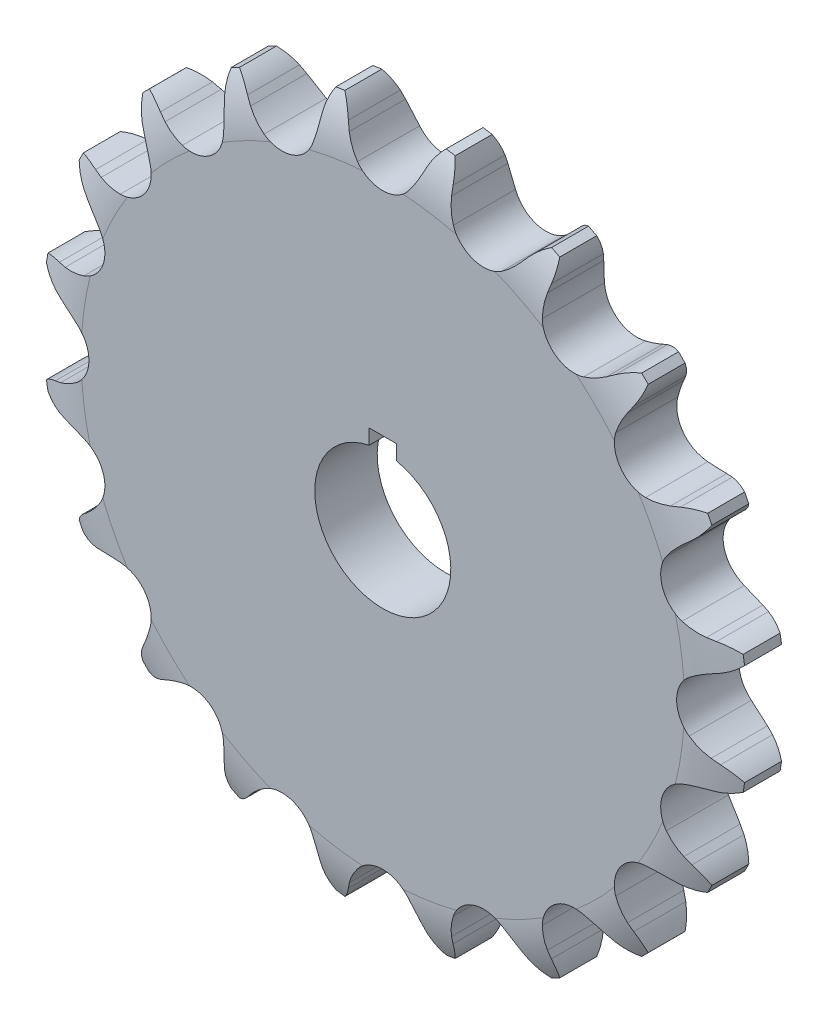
from build123d import *

# Parameters (mm, degrees)
SKETCH1_R          = 65.853483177
BASE_EXTRUDE_DEPTH = 5.8293
CUT_EXTRUDE2_DEPTH = 94.857793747
CIRPATTERN1_COUNT  = 20
CUT_EXTRUDE3_DEPTH = 93.901152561


with BuildPart() as part:
    # Sketch1 → Base-Extrude (new, symmetric)
    with BuildSketch(Plane.XY):
        with Locations(Location((0, 0, 0), (0, 0, 180))):
            Circle(SKETCH1_R)
    extrude(amount=BASE_EXTRUDE_DEPTH, both=True)

    # Sketch3 → Cut-Revolve1 (revolve, cut)
    with BuildSketch(Plane(origin=(0, 0, 0), x_dir=(0, 0, -1), z_dir=(1, 0, 0)), mode=Mode.PRIVATE) as cut_revolve1_sk:
        with BuildLine():
            Line((-5.8293, 68.393483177), (-5.8293, 56.328483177))
            ThreePointArc((-5.8293, 56.328483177), (-5.033928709, 61.946757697), (-2.710324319, 67.123483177))
            Line((-2.710324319, 67.123483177), (2.710324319, 67.123483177))
            ThreePointArc((2.710324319, 67.123483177), (5.033928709, 61.946757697), (5.8293, 56.328483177))
            Line((5.8293, 56.328483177), (5.8293, 68.393483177))
            Line((5.8293, 68.393483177), (-5.8293, 68.393483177))
        make_face()
    revolve(cut_revolve1_sk.sketch.rotate(Axis((0, 0, 0), (0, 0, 1)), 90), axis=Axis((0, 0, 0), (0, 0, 1)), mode=Mode.SUBTRACT)

    # Sketch2 → Cut-Extrude2 (cut, through all)
    with BuildSketch(Plane.XY.offset(-5.8293)):
        with BuildLine():
            Line((7.402420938, 62.09178978), (6.829095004, 60.727901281))
            ThreePointArc((6.829095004, 60.727901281), (5.905957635, 58.884438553), (4.747119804, 57.179260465))
            ThreePointArc((4.747119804, 57.179260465), (0, 54.863935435), (-4.747119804, 57.179260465))
            ThreePointArc((-4.747119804, 57.179260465), (-5.905957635, 58.884438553), (-6.829095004, 60.727901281))
            Line((-6.829095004, 60.727901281), (-7.402420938, 62.09178978))
            ThreePointArc((-7.402420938, 62.09178978), (-8.28090036, 63.728915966), (-9.451490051, 65.171700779))
            ThreePointArc((-9.451490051, 65.171700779), (0, 65.853483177), (9.451490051, 65.171700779))
            ThreePointArc((9.451490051, 65.171700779), (8.28090036, 63.728915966), (7.402420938, 62.09178978))
        make_face()
    cut_extrude2 = extrude(amount=CUT_EXTRUDE2_DEPTH, mode=Mode.SUBTRACT)

    # CirPattern1: Cut-Extrude2 ×20 about axis
    cirpattern1_axis = Axis((0, 0, 0), (0, 0, 1))
    for i in range(1, CIRPATTERN1_COUNT):
        add(cut_extrude2.rotate(cirpattern1_axis, i * 360 / CIRPATTERN1_COUNT), mode=Mode.SUBTRACT)

    # Sketch4 → Cut-Extrude3 (cut, through all)
    with BuildSketch(Plane.XY.offset(5.8293)):
        with BuildLine():
            Line((-2.54, 12.443407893), (-2.54, 15.24))
            Line((-2.54, 15.24), (2.54, 15.24))
            Line((2.54, 15.24), (2.54, 12.443407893))
            ThreePointArc((2.54, 12.443407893), (0, -12.7), (-2.54, 12.443407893))
        make_face()
    extrude(amount=-CUT_EXTRUDE3_DEPTH, mode=Mode.SUBTRACT)


solid = part.part
